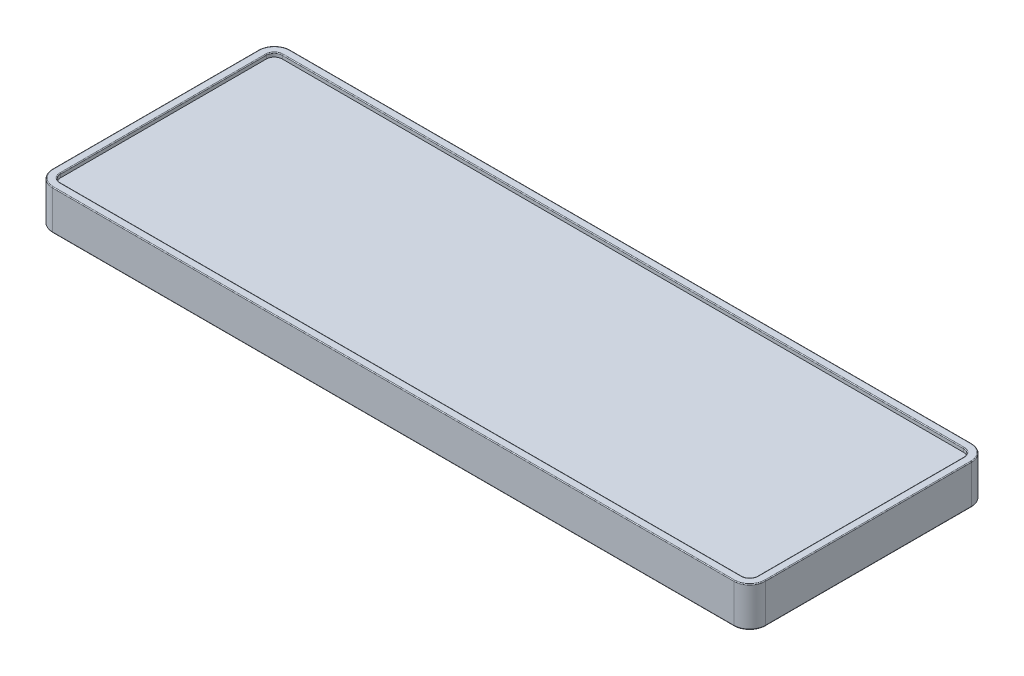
from build123d import *

# Parameters (mm, degrees)
SALIENTE_EXTRUIR1_DEPTH = 50
CORTAR_EXTRUIR1_DEPTH   = 5
VACIADO1_T              = -10
REDONDEO1_R             = 1
REDONDEO2_R             = 1


with BuildPart() as part:
    # Croquis1 → Saliente-Extruir1 (new body)
    with BuildSketch(Plane(origin=(0, 0, 0), x_dir=(1, 0, 0), z_dir=(0, 1, 0))):
        with BuildLine():
            Line((-430, -150), (430, -150))
            ThreePointArc((430, -150), (444.142135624, -144.142135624), (450, -130))
            Line((450, -130), (450, 130))
            ThreePointArc((450, 130), (444.142135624, 144.142135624), (430, 150))
            Line((430, 150), (-430, 150))
            ThreePointArc((-430, 150), (-444.142135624, 144.142135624), (-450, 130))
            Line((-450, 130), (-450, -130))
            ThreePointArc((-450, -130), (-444.142135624, -144.142135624), (-430, -150))
        make_face()
    extrude(amount=SALIENTE_EXTRUIR1_DEPTH)

    # Croquis2 → Cortar-Extruir1 (cut)
    with BuildSketch(Plane(origin=(0, 50, 0), x_dir=(1, 0, 0), z_dir=(0, 1, 0))):
        with BuildLine():
            Line((-430, -140), (430, -140))
            ThreePointArc((430, -140), (437.071067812, -137.071067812), (440, -130))
            Line((440, -130), (440, 130))
            ThreePointArc((440, 130), (437.071067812, 137.071067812), (430, 140))
            Line((430, 140), (-430, 140))
            ThreePointArc((-430, 140), (-437.071067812, 137.071067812), (-440, 130))
            Line((-440, 130), (-440, -130))
            ThreePointArc((-440, -130), (-437.071067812, -137.071067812), (-430, -140))
        make_face()
    extrude(amount=-CORTAR_EXTRUIR1_DEPTH, mode=Mode.SUBTRACT)

    # Vaciado1
    vaciado1_openings = [part.faces().sort_by_distance(p)[0] for p in [
        (0, 0, 0),
    ]]
    offset(amount=VACIADO1_T, openings=vaciado1_openings, kind=Kind.INTERSECTION)

    # Redondeo1
    redondeo1_edges = [part.edges().sort_by_distance(p)[0] for p in [
        (444.142135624, 50, 144.142135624),
        (450, 50, 0),
        (444.142135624, 50, -144.142135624),
        (0, 50, -150),
        (-444.142135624, 50, -144.142135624),
        (-437.071067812, 50, 137.071067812),
        (0, 50, 140),
        (437.071067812, 50, 137.071067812),
        (440, 50, 0),
        (-450, 50, 0),
        (437.071067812, 50, -137.071067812),
        (0, 50, -140),
        (-437.071067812, 50, -137.071067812),
        (-440, 50, 0),
        (-444.142135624, 50, 144.142135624),
        (0, 50, 150),
    ]]
    fillet(redondeo1_edges, radius=REDONDEO1_R)

    # Redondeo2
    redondeo2_edges = [part.edges().sort_by_distance(p)[0] for p in [
        (450, 0, 0),
        (444.142135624, 0, 144.142135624),
        (0, 0, 150),
        (-444.142135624, 0, 144.142135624),
        (-437.071067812, 0, 137.071067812),
        (0, 0, 140),
        (437.071067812, 0, 137.071067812),
        (440, 0, 0),
        (437.071067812, 0, -137.071067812),
        (0, 0, -140),
        (-437.071067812, 0, -137.071067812),
        (-440, 0, 0),
        (-450, 0, 0),
        (-444.142135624, 0, -144.142135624),
        (0, 0, -150),
        (444.142135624, 0, -144.142135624),
    ]]
    fillet(redondeo2_edges, radius=REDONDEO2_R)


solid = part.part
